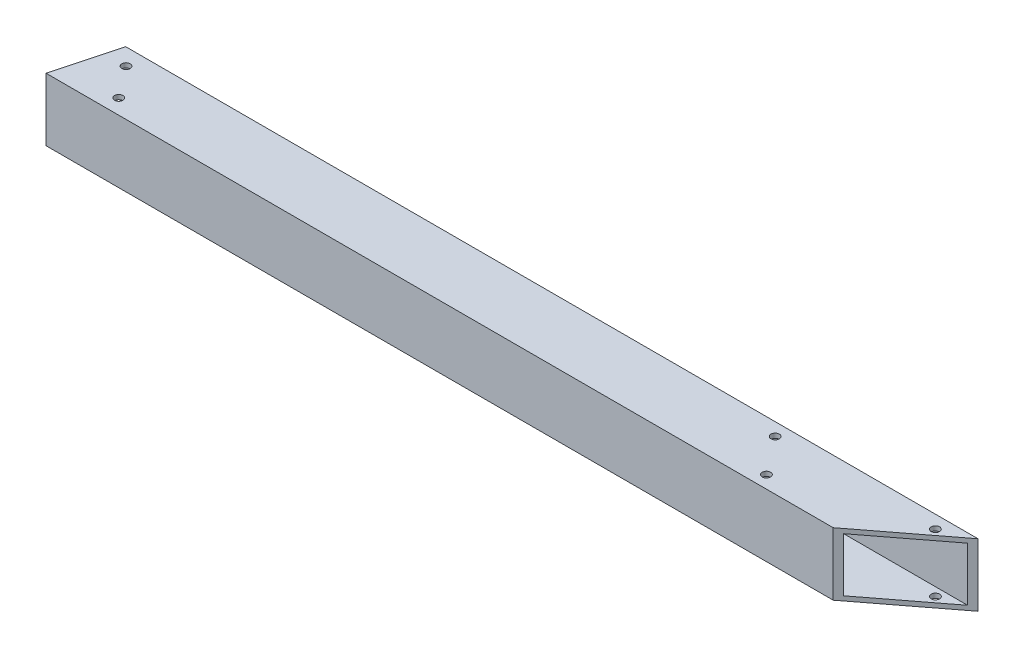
from build123d import *

# Parameters (mm, degrees)
SKETCH1_W           = 50.8
SKETCH1_H           = 50.8
SKETCH1_W_2         = 43.4848
SKETCH1_H_2         = 43.4848
EXTRUDE1_DEPTH      = 3048
SKETCH10_W          = 1961.990435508
SKETCH10_H          = 307.115176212
EXTRUDE2_DEPTH      = 3049.846549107
SKETCH11_W          = 3.896957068
SKETCH11_H          = 52.407674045
EXTRUDE3_DEPTH      = 1448.298173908
CUT_EXTRUDE8_DEPTH  = 1447.501990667
CUT_EXTRUDE9_DEPTH  = 1447.501990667
SKETCH14_R          = 3.37312
CUT_EXTRUDE10_DEPTH = 1447.501990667
SKETCH15_R          = 3.37312
CUT_EXTRUDE11_DEPTH = 1447.501990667


with BuildPart() as part:
    # Sketch1 → Extrude1 (new body)
    with BuildSketch(Plane(origin=(0, 0, 0), x_dir=(0, 0, -1), z_dir=(1, 0, 0))):
        with Locations((25.4, 25.4)):
            Rectangle(SKETCH1_W, SKETCH1_H)
        with Locations((25.4, 25.4)):
            Rectangle(SKETCH1_W_2, SKETCH1_H_2, mode=Mode.SUBTRACT)
    extrude(amount=EXTRUDE1_DEPTH)

    # Sketch10 → Extrude2 (cut, through all)
    with BuildSketch(Plane.XY):
        with Locations((2426.509217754, 12.917035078)):
            Rectangle(SKETCH10_W, SKETCH10_H)
    extrude(amount=-EXTRUDE2_DEPTH, mode=Mode.SUBTRACT)

    # Sketch11 → Extrude3 (cut, through all)
    with BuildSketch(Plane.XY):
        with Locations((1446.665312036, 24.596162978)):
            Rectangle(SKETCH11_W, SKETCH11_H)
    extrude(amount=-EXTRUDE3_DEPTH, mode=Mode.SUBTRACT)

    # Sketch12 → Cut-Extrude8 (cut, through all)
    with BuildSketch(Plane.XZ):
        Polygon((0, 0), (88.993764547, -68.169046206), (0, -57.652544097), align=None)
        Polygon((1444.716833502, -50.8), (1366.857806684, 8.839859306), (1444.716833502, 8.839859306), align=None)
    extrude(amount=-CUT_EXTRUDE8_DEPTH, mode=Mode.SUBTRACT)

    # Sketch13 → Cut-Extrude9 (cut, through all)
    with BuildSketch(Plane(origin=(0, 50.8, 0), x_dir=(1, 0, 0), z_dir=(0, 1, 0))):
        Polygon((736.645884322, -19.162163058), (775.759046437, 125.838769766), (-25.457281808, 125.838769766), (-25.457281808, -19.162163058), align=None)
    extrude(amount=-CUT_EXTRUDE9_DEPTH, mode=Mode.SUBTRACT)

    # Sketch14 → Cut-Extrude10 (cut, through all)
    with BuildSketch(Plane(origin=(0, 50.8, 0), x_dir=(1, 0, 0), z_dir=(0, 1, 0))):
        with Locations(Location((788.536944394, 12.101699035, 0), (0, 0, 270))):
            Circle(SKETCH14_R)
        with Locations(Location((769.229859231, 37.306836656, 0), (0, 0, 270))):
            Circle(SKETCH14_R)
    extrude(amount=-CUT_EXTRUDE10_DEPTH, mode=Mode.SUBTRACT)

    # Sketch15 → Cut-Extrude11 (cut, through all)
    with BuildSketch(Plane(origin=(0, 50.8, 0), x_dir=(1, 0, 0), z_dir=(0, 1, 0))):
        with Locations(Location((1420.778535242, 40.281485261, 0), (0, 0, 270))):
            Circle(SKETCH15_R)
        with Locations(Location((1314.252875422, 10.175869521, 0), (0, 0, 270))):
            Circle(SKETCH15_R)
        with Locations(Location((1291.084373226, 40.422034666, 0), (0, 0, 270))):
            Circle(SKETCH15_R)
    extrude(amount=-CUT_EXTRUDE11_DEPTH, mode=Mode.SUBTRACT)


solid = part.part
